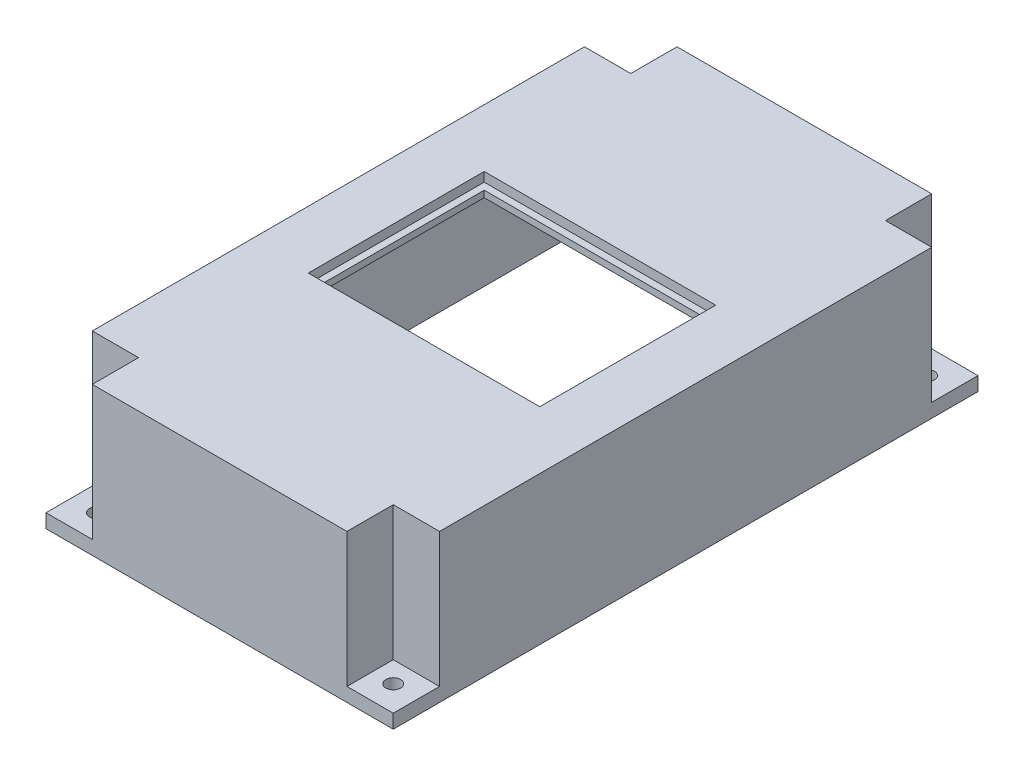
ISO-10303-21;
HEADER;
FILE_DESCRIPTION(('STEP AP214'),'2;1');
FILE_NAME('part.step','',(''),(''),'','','');
FILE_SCHEMA(('AUTOMOTIVE_DESIGN { 1 0 10303 214 1 1 1 1 }'));
ENDSEC;
DATA;
#1=APPLICATION_CONTEXT('core data for automotive mechanical design processes');
#2=APPLICATION_PROTOCOL_DEFINITION('international standard','automotive_design',2000,#1);
#3=PRODUCT_CONTEXT('',#1,'mechanical');
#4=PRODUCT('Part','Part','',(#3));
#5=PRODUCT_RELATED_PRODUCT_CATEGORY('part','',(#4));
#6=PRODUCT_DEFINITION_FORMATION('','',#4);
#7=PRODUCT_DEFINITION_CONTEXT('part definition',#1,'design');
#8=PRODUCT_DEFINITION('design','',#6,#7);
#9=PRODUCT_DEFINITION_SHAPE('','',#8);
#10=(LENGTH_UNIT() NAMED_UNIT(*) SI_UNIT(.MILLI.,.METRE.));
#11=(NAMED_UNIT(*) PLANE_ANGLE_UNIT() SI_UNIT($,.RADIAN.));
#12=(NAMED_UNIT(*) SI_UNIT($,.STERADIAN.) SOLID_ANGLE_UNIT());
#13=UNCERTAINTY_MEASURE_WITH_UNIT(LENGTH_MEASURE(1.E-05),#10,'distance_accuracy_value','');
#14=(GEOMETRIC_REPRESENTATION_CONTEXT(3) GLOBAL_UNCERTAINTY_ASSIGNED_CONTEXT((#13)) GLOBAL_UNIT_ASSIGNED_CONTEXT((#10,
#11,#12)) REPRESENTATION_CONTEXT('',''));
#15=CARTESIAN_POINT('',(0.,0.,0.));
#16=DIRECTION('',(0.,0.,1.));
#17=DIRECTION('',(1.,0.,0.));
#18=AXIS2_PLACEMENT_3D('',#15,#16,#17);
#19=CARTESIAN_POINT('',(0.,30.,0.));
#20=DIRECTION('',(0.,1.,0.));
#21=DIRECTION('',(0.,0.,1.));
#22=AXIS2_PLACEMENT_3D('',#19,#20,#21);
#23=PLANE('',#22);
#24=DIRECTION('',(0.,0.,-1.));
#25=VECTOR('',#24,1.);
#26=CARTESIAN_POINT('',(-54.9274268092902,30.,-65.941177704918));
#27=LINE('',#26,#25);
#28=CARTESIAN_POINT('',(-54.9274268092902,30.,-22.441177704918));
#29=VERTEX_POINT('',#28);
#30=CARTESIAN_POINT('',(-54.9274268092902,30.,-67.441177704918));
#31=VERTEX_POINT('',#30);
#32=EDGE_CURVE('E618',#29,#31,#27,.T.);
#33=ORIENTED_EDGE('',*,*,#32,.T.);
#34=DIRECTION('',(-1.,0.,0.));
#35=VECTOR('',#34,1.);
#36=CARTESIAN_POINT('',(-110.42742680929,30.,-67.441177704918));
#37=LINE('',#36,#35);
#38=CARTESIAN_POINT('',(-111.92742680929,30.,-67.441177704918));
#39=VERTEX_POINT('',#38);
#40=EDGE_CURVE('E620',#31,#39,#37,.T.);
#41=ORIENTED_EDGE('',*,*,#40,.T.);
#42=DIRECTION('',(0.,0.,1.));
#43=VECTOR('',#42,1.);
#44=CARTESIAN_POINT('',(-111.92742680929,30.,0.));
#45=LINE('',#44,#43);
#46=CARTESIAN_POINT('',(-111.92742680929,30.,-22.441177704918));
#47=VERTEX_POINT('',#46);
#48=EDGE_CURVE('E616',#39,#47,#45,.T.);
#49=ORIENTED_EDGE('',*,*,#48,.T.);
#50=DIRECTION('',(1.,0.,0.));
#51=VECTOR('',#50,1.);
#52=CARTESIAN_POINT('',(0.,30.,-22.441177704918));
#53=LINE('',#52,#51);
#54=EDGE_CURVE('E592',#47,#29,#53,.T.);
#55=ORIENTED_EDGE('',*,*,#54,.T.);
#56=EDGE_LOOP('',(#33,#41,#49,#55));
#57=FACE_BOUND('',#56,.T.);
#58=DIRECTION('',(0.,0.,-1.));
#59=VECTOR('',#58,1.);
#60=CARTESIAN_POINT('',(-47.9274268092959,30.,0.));
#61=LINE('',#60,#59);
#62=CARTESIAN_POINT('',(-47.9274268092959,30.,6.20882229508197));
#63=VERTEX_POINT('',#62);
#64=CARTESIAN_POINT('',(-47.9274268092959,30.,-96.091177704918));
#65=VERTEX_POINT('',#64);
#66=EDGE_CURVE('E479',#63,#65,#61,.T.);
#67=ORIENTED_EDGE('',*,*,#66,.F.);
#68=DIRECTION('',(-1.,0.,0.));
#69=VECTOR('',#68,1.);
#70=CARTESIAN_POINT('',(0.,30.,6.20882229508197));
#71=LINE('',#70,#69);
#72=CARTESIAN_POINT('',(-57.9274268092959,30.,6.20882229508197));
#73=VERTEX_POINT('',#72);
#74=EDGE_CURVE('E482',#63,#73,#71,.T.);
#75=ORIENTED_EDGE('',*,*,#74,.T.);
#76=DIRECTION('',(0.,0.,-1.));
#77=VECTOR('',#76,1.);
#78=CARTESIAN_POINT('',(-57.9274268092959,30.,0.));
#79=LINE('',#78,#77);
#80=CARTESIAN_POINT('',(-57.9274268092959,30.,16.208822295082));
#81=VERTEX_POINT('',#80);
#82=EDGE_CURVE('E485',#81,#73,#79,.T.);
#83=ORIENTED_EDGE('',*,*,#82,.F.);
#84=DIRECTION('',(1.,0.,0.));
#85=VECTOR('',#84,1.);
#86=CARTESIAN_POINT('',(0.,30.,16.208822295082));
#87=LINE('',#86,#85);
#88=CARTESIAN_POINT('',(-108.92742680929,30.,16.208822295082));
#89=VERTEX_POINT('',#88);
#90=EDGE_CURVE('E488',#89,#81,#87,.T.);
#91=ORIENTED_EDGE('',*,*,#90,.F.);
#92=DIRECTION('',(0.,0.,-1.));
#93=VECTOR('',#92,1.);
#94=CARTESIAN_POINT('',(-108.92742680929,30.,0.));
#95=LINE('',#94,#93);
#96=CARTESIAN_POINT('',(-108.92742680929,30.,6.20882229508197));
#97=VERTEX_POINT('',#96);
#98=EDGE_CURVE('E491',#89,#97,#95,.T.);
#99=ORIENTED_EDGE('',*,*,#98,.T.);
#100=DIRECTION('',(1.,0.,0.));
#101=VECTOR('',#100,1.);
#102=CARTESIAN_POINT('',(0.,30.,6.20882229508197));
#103=LINE('',#102,#101);
#104=CARTESIAN_POINT('',(-118.92742680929,30.,6.20882229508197));
#105=VERTEX_POINT('',#104);
#106=EDGE_CURVE('E493',#105,#97,#103,.T.);
#107=ORIENTED_EDGE('',*,*,#106,.F.);
#108=DIRECTION('',(0.,0.,1.));
#109=VECTOR('',#108,1.);
#110=CARTESIAN_POINT('',(-118.92742680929,30.,0.));
#111=LINE('',#110,#109);
#112=CARTESIAN_POINT('',(-118.92742680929,30.,-96.091177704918));
#113=VERTEX_POINT('',#112);
#114=EDGE_CURVE('E496',#113,#105,#111,.T.);
#115=ORIENTED_EDGE('',*,*,#114,.F.);
#116=DIRECTION('',(1.,0.,0.));
#117=VECTOR('',#116,1.);
#118=CARTESIAN_POINT('',(0.,30.,-96.091177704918));
#119=LINE('',#118,#117);
#120=CARTESIAN_POINT('',(-108.92742680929,30.,-96.091177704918));
#121=VERTEX_POINT('',#120);
#122=EDGE_CURVE('E499',#113,#121,#119,.T.);
#123=ORIENTED_EDGE('',*,*,#122,.T.);
#124=DIRECTION('',(0.,0.,1.));
#125=VECTOR('',#124,1.);
#126=CARTESIAN_POINT('',(-108.92742680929,30.,0.));
#127=LINE('',#126,#125);
#128=CARTESIAN_POINT('',(-108.92742680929,30.,-106.091177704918));
#129=VERTEX_POINT('',#128);
#130=EDGE_CURVE('E501',#129,#121,#127,.T.);
#131=ORIENTED_EDGE('',*,*,#130,.F.);
#132=DIRECTION('',(-1.,0.,0.));
#133=VECTOR('',#132,1.);
#134=CARTESIAN_POINT('',(0.,30.,-106.091177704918));
#135=LINE('',#134,#133);
#136=CARTESIAN_POINT('',(-57.9274268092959,30.,-106.091177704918));
#137=VERTEX_POINT('',#136);
#138=EDGE_CURVE('E504',#137,#129,#135,.T.);
#139=ORIENTED_EDGE('',*,*,#138,.F.);
#140=DIRECTION('',(0.,0.,1.));
#141=VECTOR('',#140,1.);
#142=CARTESIAN_POINT('',(-57.9274268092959,30.,0.));
#143=LINE('',#142,#141);
#144=CARTESIAN_POINT('',(-57.9274268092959,30.,-96.091177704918));
#145=VERTEX_POINT('',#144);
#146=EDGE_CURVE('E507',#137,#145,#143,.T.);
#147=ORIENTED_EDGE('',*,*,#146,.T.);
#148=DIRECTION('',(-1.,0.,0.));
#149=VECTOR('',#148,1.);
#150=CARTESIAN_POINT('',(0.,30.,-96.091177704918));
#151=LINE('',#150,#149);
#152=EDGE_CURVE('E509',#65,#145,#151,.T.);
#153=ORIENTED_EDGE('',*,*,#152,.F.);
#154=EDGE_LOOP('',(#67,#75,#83,#91,#99,#107,#115,#123,#131,#139,#147,#153));
#155=FACE_BOUND('',#154,.T.);
#156=ADVANCED_FACE('F39',(#57,#155),#23,.F.);
#157=CARTESIAN_POINT('',(0.,32.,0.));
#158=DIRECTION('',(0.,1.,0.));
#159=DIRECTION('',(0.,0.,1.));
#160=AXIS2_PLACEMENT_3D('',#157,#158,#159);
#161=PLANE('',#160);
#162=DIRECTION('',(-1.,0.,0.));
#163=VECTOR('',#162,1.);
#164=CARTESIAN_POINT('',(-110.92742680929,32.,-98.091177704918));
#165=LINE('',#164,#163);
#166=CARTESIAN_POINT('',(-110.92742680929,32.,-98.091177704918));
#167=VERTEX_POINT('',#166);
#168=CARTESIAN_POINT('',(-120.92742680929,32.,-98.091177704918));
#169=VERTEX_POINT('',#168);
#170=EDGE_CURVE('E366',#167,#169,#165,.T.);
#171=ORIENTED_EDGE('',*,*,#170,.T.);
#172=DIRECTION('',(0.,0.,1.));
#173=VECTOR('',#172,1.);
#174=CARTESIAN_POINT('',(-120.92742680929,32.,-98.091177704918));
#175=LINE('',#174,#173);
#176=CARTESIAN_POINT('',(-120.92742680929,32.,8.20882229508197));
#177=VERTEX_POINT('',#176);
#178=EDGE_CURVE('E369',#169,#177,#175,.T.);
#179=ORIENTED_EDGE('',*,*,#178,.T.);
#180=DIRECTION('',(1.,0.,0.));
#181=VECTOR('',#180,1.);
#182=CARTESIAN_POINT('',(-120.92742680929,32.,8.20882229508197));
#183=LINE('',#182,#181);
#184=CARTESIAN_POINT('',(-110.92742680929,32.,8.20882229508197));
#185=VERTEX_POINT('',#184);
#186=EDGE_CURVE('E372',#177,#185,#183,.T.);
#187=ORIENTED_EDGE('',*,*,#186,.T.);
#188=DIRECTION('',(0.,0.,1.));
#189=VECTOR('',#188,1.);
#190=CARTESIAN_POINT('',(-110.92742680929,32.,8.20882229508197));
#191=LINE('',#190,#189);
#192=CARTESIAN_POINT('',(-110.92742680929,32.,18.208822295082));
#193=VERTEX_POINT('',#192);
#194=EDGE_CURVE('E375',#185,#193,#191,.T.);
#195=ORIENTED_EDGE('',*,*,#194,.T.);
#196=DIRECTION('',(1.,0.,0.));
#197=VECTOR('',#196,1.);
#198=CARTESIAN_POINT('',(-110.92742680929,32.,18.208822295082));
#199=LINE('',#198,#197);
#200=CARTESIAN_POINT('',(-55.9274268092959,32.,18.208822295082));
#201=VERTEX_POINT('',#200);
#202=EDGE_CURVE('E378',#193,#201,#199,.T.);
#203=ORIENTED_EDGE('',*,*,#202,.T.);
#204=DIRECTION('',(0.,0.,-1.));
#205=VECTOR('',#204,1.);
#206=CARTESIAN_POINT('',(-55.9274268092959,32.,18.208822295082));
#207=LINE('',#206,#205);
#208=CARTESIAN_POINT('',(-55.9274268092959,32.,8.20882229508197));
#209=VERTEX_POINT('',#208);
#210=EDGE_CURVE('E381',#201,#209,#207,.T.);
#211=ORIENTED_EDGE('',*,*,#210,.T.);
#212=DIRECTION('',(1.,0.,0.));
#213=VECTOR('',#212,1.);
#214=CARTESIAN_POINT('',(-55.9274268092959,32.,8.20882229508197));
#215=LINE('',#214,#213);
#216=CARTESIAN_POINT('',(-45.9274268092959,32.,8.20882229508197));
#217=VERTEX_POINT('',#216);
#218=EDGE_CURVE('E384',#209,#217,#215,.T.);
#219=ORIENTED_EDGE('',*,*,#218,.T.);
#220=DIRECTION('',(0.,0.,-1.));
#221=VECTOR('',#220,1.);
#222=CARTESIAN_POINT('',(-45.9274268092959,32.,8.20882229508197));
#223=LINE('',#222,#221);
#224=CARTESIAN_POINT('',(-45.9274268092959,32.,-98.091177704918));
#225=VERTEX_POINT('',#224);
#226=EDGE_CURVE('E387',#217,#225,#223,.T.);
#227=ORIENTED_EDGE('',*,*,#226,.T.);
#228=DIRECTION('',(-1.,0.,0.));
#229=VECTOR('',#228,1.);
#230=CARTESIAN_POINT('',(-45.9274268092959,32.,-98.091177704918));
#231=LINE('',#230,#229);
#232=CARTESIAN_POINT('',(-55.9274268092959,32.,-98.091177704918));
#233=VERTEX_POINT('',#232);
#234=EDGE_CURVE('E390',#225,#233,#231,.T.);
#235=ORIENTED_EDGE('',*,*,#234,.T.);
#236=DIRECTION('',(0.,0.,-1.));
#237=VECTOR('',#236,1.);
#238=CARTESIAN_POINT('',(-55.9274268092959,32.,-98.091177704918));
#239=LINE('',#238,#237);
#240=CARTESIAN_POINT('',(-55.9274268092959,32.,-108.091177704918));
#241=VERTEX_POINT('',#240);
#242=EDGE_CURVE('E393',#233,#241,#239,.T.);
#243=ORIENTED_EDGE('',*,*,#242,.T.);
#244=DIRECTION('',(-1.,0.,0.));
#245=VECTOR('',#244,1.);
#246=CARTESIAN_POINT('',(-55.9274268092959,32.,-108.091177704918));
#247=LINE('',#246,#245);
#248=CARTESIAN_POINT('',(-110.92742680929,32.,-108.091177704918));
#249=VERTEX_POINT('',#248);
#250=EDGE_CURVE('E396',#241,#249,#247,.T.);
#251=ORIENTED_EDGE('',*,*,#250,.T.);
#252=DIRECTION('',(0.,0.,1.));
#253=VECTOR('',#252,1.);
#254=CARTESIAN_POINT('',(-110.92742680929,32.,-108.091177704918));
#255=LINE('',#254,#253);
#256=EDGE_CURVE('E399',#249,#167,#255,.T.);
#257=ORIENTED_EDGE('',*,*,#256,.T.);
#258=EDGE_LOOP('',(#171,#179,#187,#195,#203,#211,#219,#227,#235,#243,#251,#257));
#259=FACE_BOUND('',#258,.T.);
#260=DIRECTION('',(1.,0.,0.));
#261=VECTOR('',#260,1.);
#262=CARTESIAN_POINT('',(0.,32.,-63.941177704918));
#263=LINE('',#262,#261);
#264=CARTESIAN_POINT('',(-108.42742680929,32.,-63.941177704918));
#265=VERTEX_POINT('',#264);
#266=CARTESIAN_POINT('',(-58.4274268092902,32.,-63.941177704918));
#267=VERTEX_POINT('',#266);
#268=EDGE_CURVE('E338',#265,#267,#263,.T.);
#269=ORIENTED_EDGE('',*,*,#268,.T.);
#270=DIRECTION('',(0.,0.,1.));
#271=VECTOR('',#270,1.);
#272=CARTESIAN_POINT('',(-58.4274268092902,32.,0.));
#273=LINE('',#272,#271);
#274=CARTESIAN_POINT('',(-58.4274268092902,32.,-25.941177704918));
#275=VERTEX_POINT('',#274);
#276=EDGE_CURVE('E304',#267,#275,#273,.T.);
#277=ORIENTED_EDGE('',*,*,#276,.T.);
#278=DIRECTION('',(1.,0.,0.));
#279=VECTOR('',#278,1.);
#280=CARTESIAN_POINT('',(0.,32.,-25.941177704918));
#281=LINE('',#280,#279);
#282=CARTESIAN_POINT('',(-108.42742680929,32.,-25.941177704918));
#283=VERTEX_POINT('',#282);
#284=EDGE_CURVE('E344',#283,#275,#281,.T.);
#285=ORIENTED_EDGE('',*,*,#284,.F.);
#286=DIRECTION('',(0.,0.,1.));
#287=VECTOR('',#286,1.);
#288=CARTESIAN_POINT('',(-108.42742680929,32.,0.));
#289=LINE('',#288,#287);
#290=EDGE_CURVE('E341',#265,#283,#289,.T.);
#291=ORIENTED_EDGE('',*,*,#290,.F.);
#292=EDGE_LOOP('',(#269,#277,#285,#291));
#293=FACE_BOUND('',#292,.T.);
#294=ADVANCED_FACE('F668',(#259,#293),#161,.T.);
#295=CARTESIAN_POINT('',(-120.92742680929,30.,0.));
#296=DIRECTION('',(1.,0.,0.));
#297=DIRECTION('',(0.,0.,-1.));
#298=AXIS2_PLACEMENT_3D('',#295,#296,#297);
#299=PLANE('',#298);
#300=DIRECTION('',(0.,0.,1.));
#301=VECTOR('',#300,1.);
#302=CARTESIAN_POINT('',(-120.92742680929,0.,0.));
#303=LINE('',#302,#301);
#304=CARTESIAN_POINT('',(-120.92742680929,0.,-108.091177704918));
#305=VERTEX_POINT('',#304);
#306=CARTESIAN_POINT('',(-120.92742680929,0.,18.208822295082));
#307=VERTEX_POINT('',#306);
#308=EDGE_CURVE('E548',#305,#307,#303,.T.);
#309=ORIENTED_EDGE('',*,*,#308,.T.);
#310=DIRECTION('',(0.,-1.,0.));
#311=VECTOR('',#310,1.);
#312=CARTESIAN_POINT('',(-120.92742680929,3.,18.208822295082));
#313=LINE('',#312,#311);
#314=CARTESIAN_POINT('',(-120.92742680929,3.,18.208822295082));
#315=VERTEX_POINT('',#314);
#316=EDGE_CURVE('E473',#315,#307,#313,.T.);
#317=ORIENTED_EDGE('',*,*,#316,.F.);
#318=DIRECTION('',(0.,0.,1.));
#319=VECTOR('',#318,1.);
#320=CARTESIAN_POINT('',(-120.92742680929,3.,0.));
#321=LINE('',#320,#319);
#322=CARTESIAN_POINT('',(-120.92742680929,3.,8.20882229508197));
#323=VERTEX_POINT('',#322);
#324=EDGE_CURVE('E466',#323,#315,#321,.T.);
#325=ORIENTED_EDGE('',*,*,#324,.F.);
#326=DIRECTION('',(0.,-1.,0.));
#327=VECTOR('',#326,1.);
#328=CARTESIAN_POINT('',(-120.92742680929,30.,8.20882229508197));
#329=LINE('',#328,#327);
#330=EDGE_CURVE('E589',#177,#323,#329,.T.);
#331=ORIENTED_EDGE('',*,*,#330,.F.);
#332=ORIENTED_EDGE('',*,*,#178,.F.);
#333=DIRECTION('',(0.,-1.,0.));
#334=VECTOR('',#333,1.);
#335=CARTESIAN_POINT('',(-120.92742680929,30.,-98.091177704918));
#336=LINE('',#335,#334);
#337=CARTESIAN_POINT('',(-120.92742680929,3.,-98.091177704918));
#338=VERTEX_POINT('',#337);
#339=EDGE_CURVE('E557',#169,#338,#336,.T.);
#340=ORIENTED_EDGE('',*,*,#339,.T.);
#341=DIRECTION('',(0.,0.,1.));
#342=VECTOR('',#341,1.);
#343=CARTESIAN_POINT('',(-120.92742680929,3.,0.));
#344=LINE('',#343,#342);
#345=CARTESIAN_POINT('',(-120.92742680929,3.,-108.091177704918));
#346=VERTEX_POINT('',#345);
#347=EDGE_CURVE('E410',#346,#338,#344,.T.);
#348=ORIENTED_EDGE('',*,*,#347,.F.);
#349=DIRECTION('',(0.,-1.,0.));
#350=VECTOR('',#349,1.);
#351=CARTESIAN_POINT('',(-120.92742680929,3.,-108.091177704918));
#352=LINE('',#351,#350);
#353=EDGE_CURVE('E416',#346,#305,#352,.T.);
#354=ORIENTED_EDGE('',*,*,#353,.T.);
#355=EDGE_LOOP('',(#309,#317,#325,#331,#332,#340,#348,#354));
#356=FACE_BOUND('',#355,.T.);
#357=ADVANCED_FACE('F673',(#356),#299,.F.);
#358=CARTESIAN_POINT('',(0.,30.,8.20882229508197));
#359=DIRECTION('',(0.,0.,-1.));
#360=DIRECTION('',(-1.,0.,0.));
#361=AXIS2_PLACEMENT_3D('',#358,#359,#360);
#362=PLANE('',#361);
#363=ORIENTED_EDGE('',*,*,#330,.T.);
#364=DIRECTION('',(1.,0.,0.));
#365=VECTOR('',#364,1.);
#366=CARTESIAN_POINT('',(0.,3.,8.20882229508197));
#367=LINE('',#366,#365);
#368=CARTESIAN_POINT('',(-110.92742680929,3.,8.20882229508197));
#369=VERTEX_POINT('',#368);
#370=EDGE_CURVE('E463',#323,#369,#367,.T.);
#371=ORIENTED_EDGE('',*,*,#370,.T.);
#372=DIRECTION('',(0.,-1.,0.));
#373=VECTOR('',#372,1.);
#374=CARTESIAN_POINT('',(-110.92742680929,30.,8.20882229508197));
#375=LINE('',#374,#373);
#376=EDGE_CURVE('E586',#185,#369,#375,.T.);
#377=ORIENTED_EDGE('',*,*,#376,.F.);
#378=ORIENTED_EDGE('',*,*,#186,.F.);
#379=EDGE_LOOP('',(#363,#371,#377,#378));
#380=FACE_BOUND('',#379,.T.);
#381=ADVANCED_FACE('F756',(#380),#362,.F.);
#382=CARTESIAN_POINT('',(-110.92742680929,30.,1.5394272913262E-13));
#383=DIRECTION('',(-1.,0.,0.));
#384=DIRECTION('',(0.,0.,1.));
#385=AXIS2_PLACEMENT_3D('',#382,#383,#384);
#386=PLANE('',#385);
#387=DIRECTION('',(0.,0.,-1.));
#388=VECTOR('',#387,1.);
#389=CARTESIAN_POINT('',(-110.92742680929,3.,1.5394272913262E-13));
#390=LINE('',#389,#388);
#391=CARTESIAN_POINT('',(-110.92742680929,3.,18.208822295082));
#392=VERTEX_POINT('',#391);
#393=EDGE_CURVE('E471',#392,#369,#390,.T.);
#394=ORIENTED_EDGE('',*,*,#393,.F.);
#395=DIRECTION('',(0.,-1.,0.));
#396=VECTOR('',#395,1.);
#397=CARTESIAN_POINT('',(-110.92742680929,30.,18.208822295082));
#398=LINE('',#397,#396);
#399=EDGE_CURVE('E583',#193,#392,#398,.T.);
#400=ORIENTED_EDGE('',*,*,#399,.F.);
#401=ORIENTED_EDGE('',*,*,#194,.F.);
#402=ORIENTED_EDGE('',*,*,#376,.T.);
#403=EDGE_LOOP('',(#394,#400,#401,#402));
#404=FACE_BOUND('',#403,.T.);
#405=ADVANCED_FACE('F752',(#404),#386,.T.);
#406=CARTESIAN_POINT('',(0.,30.,18.208822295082));
#407=DIRECTION('',(0.,0.,-1.));
#408=DIRECTION('',(-1.,0.,0.));
#409=AXIS2_PLACEMENT_3D('',#406,#407,#408);
#410=PLANE('',#409);
#411=DIRECTION('',(1.,0.,0.));
#412=VECTOR('',#411,1.);
#413=CARTESIAN_POINT('',(0.,0.,18.208822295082));
#414=LINE('',#413,#412);
#415=CARTESIAN_POINT('',(-45.9274268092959,0.,18.208822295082));
#416=VERTEX_POINT('',#415);
#417=EDGE_CURVE('E550',#307,#416,#414,.T.);
#418=ORIENTED_EDGE('',*,*,#417,.T.);
#419=DIRECTION('',(0.,-1.,0.));
#420=VECTOR('',#419,1.);
#421=CARTESIAN_POINT('',(-45.9274268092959,3.,18.208822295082));
#422=LINE('',#421,#420);
#423=CARTESIAN_POINT('',(-45.9274268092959,3.,18.208822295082));
#424=VERTEX_POINT('',#423);
#425=EDGE_CURVE('E454',#424,#416,#422,.T.);
#426=ORIENTED_EDGE('',*,*,#425,.F.);
#427=DIRECTION('',(1.,0.,0.));
#428=VECTOR('',#427,1.);
#429=CARTESIAN_POINT('',(0.,3.,18.208822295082));
#430=LINE('',#429,#428);
#431=CARTESIAN_POINT('',(-55.9274268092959,3.,18.208822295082));
#432=VERTEX_POINT('',#431);
#433=EDGE_CURVE('E447',#432,#424,#430,.T.);
#434=ORIENTED_EDGE('',*,*,#433,.F.);
#435=DIRECTION('',(0.,-1.,0.));
#436=VECTOR('',#435,1.);
#437=CARTESIAN_POINT('',(-55.9274268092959,30.,18.208822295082));
#438=LINE('',#437,#436);
#439=EDGE_CURVE('E580',#201,#432,#438,.T.);
#440=ORIENTED_EDGE('',*,*,#439,.F.);
#441=ORIENTED_EDGE('',*,*,#202,.F.);
#442=ORIENTED_EDGE('',*,*,#399,.T.);
#443=DIRECTION('',(1.,0.,0.));
#444=VECTOR('',#443,1.);
#445=CARTESIAN_POINT('',(0.,3.,18.208822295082));
#446=LINE('',#445,#444);
#447=EDGE_CURVE('E469',#315,#392,#446,.T.);
#448=ORIENTED_EDGE('',*,*,#447,.F.);
#449=ORIENTED_EDGE('',*,*,#316,.T.);
#450=EDGE_LOOP('',(#418,#426,#434,#440,#441,#442,#448,#449));
#451=FACE_BOUND('',#450,.T.);
#452=ADVANCED_FACE('F748',(#451),#410,.F.);
#453=CARTESIAN_POINT('',(-55.9274268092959,30.,0.));
#454=DIRECTION('',(-1.,0.,0.));
#455=DIRECTION('',(0.,0.,1.));
#456=AXIS2_PLACEMENT_3D('',#453,#454,#455);
#457=PLANE('',#456);
#458=ORIENTED_EDGE('',*,*,#439,.T.);
#459=DIRECTION('',(0.,0.,-1.));
#460=VECTOR('',#459,1.);
#461=CARTESIAN_POINT('',(-55.9274268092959,3.,0.));
#462=LINE('',#461,#460);
#463=CARTESIAN_POINT('',(-55.9274268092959,3.,8.20882229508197));
#464=VERTEX_POINT('',#463);
#465=EDGE_CURVE('E444',#432,#464,#462,.T.);
#466=ORIENTED_EDGE('',*,*,#465,.T.);
#467=DIRECTION('',(0.,-1.,0.));
#468=VECTOR('',#467,1.);
#469=CARTESIAN_POINT('',(-55.9274268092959,30.,8.20882229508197));
#470=LINE('',#469,#468);
#471=EDGE_CURVE('E577',#209,#464,#470,.T.);
#472=ORIENTED_EDGE('',*,*,#471,.F.);
#473=ORIENTED_EDGE('',*,*,#210,.F.);
#474=EDGE_LOOP('',(#458,#466,#472,#473));
#475=FACE_BOUND('',#474,.T.);
#476=ADVANCED_FACE('F744',(#475),#457,.F.);
#477=CARTESIAN_POINT('',(0.,30.,8.20882229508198));
#478=DIRECTION('',(0.,0.,1.));
#479=DIRECTION('',(1.,0.,0.));
#480=AXIS2_PLACEMENT_3D('',#477,#478,#479);
#481=PLANE('',#480);
#482=DIRECTION('',(-1.,0.,0.));
#483=VECTOR('',#482,1.);
#484=CARTESIAN_POINT('',(0.,3.,8.20882229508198));
#485=LINE('',#484,#483);
#486=CARTESIAN_POINT('',(-45.9274268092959,3.,8.20882229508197));
#487=VERTEX_POINT('',#486);
#488=EDGE_CURVE('E452',#487,#464,#485,.T.);
#489=ORIENTED_EDGE('',*,*,#488,.F.);
#490=DIRECTION('',(0.,-1.,0.));
#491=VECTOR('',#490,1.);
#492=CARTESIAN_POINT('',(-45.9274268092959,30.,8.20882229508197));
#493=LINE('',#492,#491);
#494=EDGE_CURVE('E574',#217,#487,#493,.T.);
#495=ORIENTED_EDGE('',*,*,#494,.F.);
#496=ORIENTED_EDGE('',*,*,#218,.F.);
#497=ORIENTED_EDGE('',*,*,#471,.T.);
#498=EDGE_LOOP('',(#489,#495,#496,#497));
#499=FACE_BOUND('',#498,.T.);
#500=ADVANCED_FACE('F740',(#499),#481,.T.);
#501=CARTESIAN_POINT('',(-45.9274268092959,30.,0.));
#502=DIRECTION('',(-1.,0.,0.));
#503=DIRECTION('',(0.,0.,1.));
#504=AXIS2_PLACEMENT_3D('',#501,#502,#503);
#505=PLANE('',#504);
#506=DIRECTION('',(0.,0.,-1.));
#507=VECTOR('',#506,1.);
#508=CARTESIAN_POINT('',(-45.9274268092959,0.,0.));
#509=LINE('',#508,#507);
#510=CARTESIAN_POINT('',(-45.9274268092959,0.,-108.091177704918));
#511=VERTEX_POINT('',#510);
#512=EDGE_CURVE('E552',#416,#511,#509,.T.);
#513=ORIENTED_EDGE('',*,*,#512,.T.);
#514=DIRECTION('',(0.,-1.,0.));
#515=VECTOR('',#514,1.);
#516=CARTESIAN_POINT('',(-45.9274268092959,3.,-108.091177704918));
#517=LINE('',#516,#515);
#518=CARTESIAN_POINT('',(-45.9274268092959,3.,-108.091177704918));
#519=VERTEX_POINT('',#518);
#520=EDGE_CURVE('E435',#519,#511,#517,.T.);
#521=ORIENTED_EDGE('',*,*,#520,.F.);
#522=DIRECTION('',(0.,0.,-1.));
#523=VECTOR('',#522,1.);
#524=CARTESIAN_POINT('',(-45.9274268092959,3.,0.));
#525=LINE('',#524,#523);
#526=CARTESIAN_POINT('',(-45.9274268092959,3.,-98.091177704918));
#527=VERTEX_POINT('',#526);
#528=EDGE_CURVE('E430',#527,#519,#525,.T.);
#529=ORIENTED_EDGE('',*,*,#528,.F.);
#530=DIRECTION('',(0.,-1.,0.));
#531=VECTOR('',#530,1.);
#532=CARTESIAN_POINT('',(-45.9274268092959,30.,-98.091177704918));
#533=LINE('',#532,#531);
#534=EDGE_CURVE('E572',#225,#527,#533,.T.);
#535=ORIENTED_EDGE('',*,*,#534,.F.);
#536=ORIENTED_EDGE('',*,*,#226,.F.);
#537=ORIENTED_EDGE('',*,*,#494,.T.);
#538=DIRECTION('',(0.,0.,-1.));
#539=VECTOR('',#538,1.);
#540=CARTESIAN_POINT('',(-45.9274268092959,3.,0.));
#541=LINE('',#540,#539);
#542=EDGE_CURVE('E450',#424,#487,#541,.T.);
#543=ORIENTED_EDGE('',*,*,#542,.F.);
#544=ORIENTED_EDGE('',*,*,#425,.T.);
#545=EDGE_LOOP('',(#513,#521,#529,#535,#536,#537,#543,#544));
#546=FACE_BOUND('',#545,.T.);
#547=ADVANCED_FACE('F736',(#546),#505,.F.);
#548=CARTESIAN_POINT('',(0.,30.,-98.091177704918));
#549=DIRECTION('',(0.,0.,1.));
#550=DIRECTION('',(1.,0.,0.));
#551=AXIS2_PLACEMENT_3D('',#548,#549,#550);
#552=PLANE('',#551);
#553=ORIENTED_EDGE('',*,*,#534,.T.);
#554=DIRECTION('',(-1.,0.,0.));
#555=VECTOR('',#554,1.);
#556=CARTESIAN_POINT('',(0.,3.,-98.091177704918));
#557=LINE('',#556,#555);
#558=CARTESIAN_POINT('',(-55.9274268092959,3.,-98.091177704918));
#559=VERTEX_POINT('',#558);
#560=EDGE_CURVE('E428',#527,#559,#557,.T.);
#561=ORIENTED_EDGE('',*,*,#560,.T.);
#562=DIRECTION('',(0.,-1.,0.));
#563=VECTOR('',#562,1.);
#564=CARTESIAN_POINT('',(-55.9274268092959,30.,-98.091177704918));
#565=LINE('',#564,#563);
#566=EDGE_CURVE('E569',#233,#559,#565,.T.);
#567=ORIENTED_EDGE('',*,*,#566,.F.);
#568=ORIENTED_EDGE('',*,*,#234,.F.);
#569=EDGE_LOOP('',(#553,#561,#567,#568));
#570=FACE_BOUND('',#569,.T.);
#571=ADVANCED_FACE('F732',(#570),#552,.F.);
#572=CARTESIAN_POINT('',(-55.9274268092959,30.,0.));
#573=DIRECTION('',(1.,0.,0.));
#574=DIRECTION('',(0.,0.,-1.));
#575=AXIS2_PLACEMENT_3D('',#572,#573,#574);
#576=PLANE('',#575);
#577=DIRECTION('',(0.,0.,1.));
#578=VECTOR('',#577,1.);
#579=CARTESIAN_POINT('',(-55.9274268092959,3.,0.));
#580=LINE('',#579,#578);
#581=CARTESIAN_POINT('',(-55.9274268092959,3.,-108.091177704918));
#582=VERTEX_POINT('',#581);
#583=EDGE_CURVE('E425',#582,#559,#580,.T.);
#584=ORIENTED_EDGE('',*,*,#583,.F.);
#585=DIRECTION('',(0.,-1.,0.));
#586=VECTOR('',#585,1.);
#587=CARTESIAN_POINT('',(-55.9274268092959,30.,-108.091177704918));
#588=LINE('',#587,#586);
#589=EDGE_CURVE('E566',#241,#582,#588,.T.);
#590=ORIENTED_EDGE('',*,*,#589,.F.);
#591=ORIENTED_EDGE('',*,*,#242,.F.);
#592=ORIENTED_EDGE('',*,*,#566,.T.);
#593=EDGE_LOOP('',(#584,#590,#591,#592));
#594=FACE_BOUND('',#593,.T.);
#595=ADVANCED_FACE('F728',(#594),#576,.T.);
#596=CARTESIAN_POINT('',(0.,30.,-108.091177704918));
#597=DIRECTION('',(0.,0.,1.));
#598=DIRECTION('',(1.,0.,0.));
#599=AXIS2_PLACEMENT_3D('',#596,#597,#598);
#600=PLANE('',#599);
#601=DIRECTION('',(-1.,0.,0.));
#602=VECTOR('',#601,1.);
#603=CARTESIAN_POINT('',(0.,0.,-108.091177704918));
#604=LINE('',#603,#602);
#605=EDGE_CURVE('E483',#511,#305,#604,.T.);
#606=ORIENTED_EDGE('',*,*,#605,.T.);
#607=ORIENTED_EDGE('',*,*,#353,.F.);
#608=DIRECTION('',(-1.,0.,0.));
#609=VECTOR('',#608,1.);
#610=CARTESIAN_POINT('',(0.,3.,-108.091177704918));
#611=LINE('',#610,#609);
#612=CARTESIAN_POINT('',(-110.92742680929,3.,-108.091177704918));
#613=VERTEX_POINT('',#612);
#614=EDGE_CURVE('E408',#613,#346,#611,.T.);
#615=ORIENTED_EDGE('',*,*,#614,.F.);
#616=DIRECTION('',(0.,-1.,0.));
#617=VECTOR('',#616,1.);
#618=CARTESIAN_POINT('',(-110.92742680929,30.,-108.091177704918));
#619=LINE('',#618,#617);
#620=EDGE_CURVE('E564',#249,#613,#619,.T.);
#621=ORIENTED_EDGE('',*,*,#620,.F.);
#622=ORIENTED_EDGE('',*,*,#250,.F.);
#623=ORIENTED_EDGE('',*,*,#589,.T.);
#624=DIRECTION('',(-1.,0.,0.));
#625=VECTOR('',#624,1.);
#626=CARTESIAN_POINT('',(0.,3.,-108.091177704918));
#627=LINE('',#626,#625);
#628=EDGE_CURVE('E422',#519,#582,#627,.T.);
#629=ORIENTED_EDGE('',*,*,#628,.F.);
#630=ORIENTED_EDGE('',*,*,#520,.T.);
#631=EDGE_LOOP('',(#606,#607,#615,#621,#622,#623,#629,#630));
#632=FACE_BOUND('',#631,.T.);
#633=ADVANCED_FACE('F724',(#632),#600,.F.);
#634=CARTESIAN_POINT('',(-110.92742680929,30.,0.));
#635=DIRECTION('',(1.,0.,0.));
#636=DIRECTION('',(0.,0.,-1.));
#637=AXIS2_PLACEMENT_3D('',#634,#635,#636);
#638=PLANE('',#637);
#639=ORIENTED_EDGE('',*,*,#620,.T.);
#640=DIRECTION('',(0.,0.,1.));
#641=VECTOR('',#640,1.);
#642=CARTESIAN_POINT('',(-110.92742680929,3.,0.));
#643=LINE('',#642,#641);
#644=CARTESIAN_POINT('',(-110.92742680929,3.,-98.091177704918));
#645=VERTEX_POINT('',#644);
#646=EDGE_CURVE('E406',#613,#645,#643,.T.);
#647=ORIENTED_EDGE('',*,*,#646,.T.);
#648=DIRECTION('',(0.,-1.,0.));
#649=VECTOR('',#648,1.);
#650=CARTESIAN_POINT('',(-110.92742680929,30.,-98.091177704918));
#651=LINE('',#650,#649);
#652=EDGE_CURVE('E560',#167,#645,#651,.T.);
#653=ORIENTED_EDGE('',*,*,#652,.F.);
#654=ORIENTED_EDGE('',*,*,#256,.F.);
#655=EDGE_LOOP('',(#639,#647,#653,#654));
#656=FACE_BOUND('',#655,.T.);
#657=ADVANCED_FACE('F720',(#656),#638,.F.);
#658=CARTESIAN_POINT('',(-47.9274268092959,30.,0.));
#659=DIRECTION('',(-1.,0.,0.));
#660=DIRECTION('',(0.,0.,1.));
#661=AXIS2_PLACEMENT_3D('',#658,#659,#660);
#662=PLANE('',#661);
#663=DIRECTION('',(0.,0.,-1.));
#664=VECTOR('',#663,1.);
#665=CARTESIAN_POINT('',(-47.9274268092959,0.,0.));
#666=LINE('',#665,#664);
#667=CARTESIAN_POINT('',(-47.9274268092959,0.,6.20882229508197));
#668=VERTEX_POINT('',#667);
#669=CARTESIAN_POINT('',(-47.9274268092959,0.,-96.091177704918));
#670=VERTEX_POINT('',#669);
#671=EDGE_CURVE('E478',#668,#670,#666,.T.);
#672=ORIENTED_EDGE('',*,*,#671,.F.);
#673=DIRECTION('',(0.,-1.,0.));
#674=VECTOR('',#673,1.);
#675=CARTESIAN_POINT('',(-47.9274268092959,30.,6.20882229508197));
#676=LINE('',#675,#674);
#677=EDGE_CURVE('E561',#63,#668,#676,.T.);
#678=ORIENTED_EDGE('',*,*,#677,.F.);
#679=ORIENTED_EDGE('',*,*,#66,.T.);
#680=DIRECTION('',(0.,-1.,0.));
#681=VECTOR('',#680,1.);
#682=CARTESIAN_POINT('',(-47.9274268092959,30.,-96.091177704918));
#683=LINE('',#682,#681);
#684=EDGE_CURVE('E512',#65,#670,#683,.T.);
#685=ORIENTED_EDGE('',*,*,#684,.T.);
#686=EDGE_LOOP('',(#672,#678,#679,#685));
#687=FACE_BOUND('',#686,.T.);
#688=ADVANCED_FACE('F723',(#687),#662,.T.);
#689=CARTESIAN_POINT('',(0.,30.,6.20882229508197));
#690=DIRECTION('',(0.,0.,1.));
#691=DIRECTION('',(1.,0.,0.));
#692=AXIS2_PLACEMENT_3D('',#689,#690,#691);
#693=PLANE('',#692);
#694=DIRECTION('',(-1.,0.,0.));
#695=VECTOR('',#694,1.);
#696=CARTESIAN_POINT('',(0.,0.,6.20882229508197));
#697=LINE('',#696,#695);
#698=CARTESIAN_POINT('',(-57.9274268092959,0.,6.20882229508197));
#699=VERTEX_POINT('',#698);
#700=EDGE_CURVE('E515',#668,#699,#697,.T.);
#701=ORIENTED_EDGE('',*,*,#700,.T.);
#702=DIRECTION('',(0.,-1.,0.));
#703=VECTOR('',#702,1.);
#704=CARTESIAN_POINT('',(-57.9274268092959,30.,6.20882229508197));
#705=LINE('',#704,#703);
#706=EDGE_CURVE('E612',#73,#699,#705,.T.);
#707=ORIENTED_EDGE('',*,*,#706,.F.);
#708=ORIENTED_EDGE('',*,*,#74,.F.);
#709=ORIENTED_EDGE('',*,*,#677,.T.);
#710=EDGE_LOOP('',(#701,#707,#708,#709));
#711=FACE_BOUND('',#710,.T.);
#712=ADVANCED_FACE('F802',(#711),#693,.F.);
#713=CARTESIAN_POINT('',(-57.9274268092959,30.,0.));
#714=DIRECTION('',(-1.,0.,0.));
#715=DIRECTION('',(0.,0.,1.));
#716=AXIS2_PLACEMENT_3D('',#713,#714,#715);
#717=PLANE('',#716);
#718=DIRECTION('',(0.,0.,-1.));
#719=VECTOR('',#718,1.);
#720=CARTESIAN_POINT('',(-57.9274268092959,0.,0.));
#721=LINE('',#720,#719);
#722=CARTESIAN_POINT('',(-57.9274268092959,0.,16.208822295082));
#723=VERTEX_POINT('',#722);
#724=EDGE_CURVE('E518',#723,#699,#721,.T.);
#725=ORIENTED_EDGE('',*,*,#724,.F.);
#726=DIRECTION('',(0.,-1.,0.));
#727=VECTOR('',#726,1.);
#728=CARTESIAN_POINT('',(-57.9274268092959,30.,16.208822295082));
#729=LINE('',#728,#727);
#730=EDGE_CURVE('E610',#81,#723,#729,.T.);
#731=ORIENTED_EDGE('',*,*,#730,.F.);
#732=ORIENTED_EDGE('',*,*,#82,.T.);
#733=ORIENTED_EDGE('',*,*,#706,.T.);
#734=EDGE_LOOP('',(#725,#731,#732,#733));
#735=FACE_BOUND('',#734,.T.);
#736=ADVANCED_FACE('F798',(#735),#717,.T.);
#737=CARTESIAN_POINT('',(0.,30.,16.208822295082));
#738=DIRECTION('',(0.,0.,-1.));
#739=DIRECTION('',(-1.,0.,0.));
#740=AXIS2_PLACEMENT_3D('',#737,#738,#739);
#741=PLANE('',#740);
#742=DIRECTION('',(1.,0.,0.));
#743=VECTOR('',#742,1.);
#744=CARTESIAN_POINT('',(0.,0.,16.208822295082));
#745=LINE('',#744,#743);
#746=CARTESIAN_POINT('',(-108.92742680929,0.,16.208822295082));
#747=VERTEX_POINT('',#746);
#748=EDGE_CURVE('E521',#747,#723,#745,.T.);
#749=ORIENTED_EDGE('',*,*,#748,.F.);
#750=DIRECTION('',(0.,-1.,0.));
#751=VECTOR('',#750,1.);
#752=CARTESIAN_POINT('',(-108.92742680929,30.,16.208822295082));
#753=LINE('',#752,#751);
#754=EDGE_CURVE('E608',#89,#747,#753,.T.);
#755=ORIENTED_EDGE('',*,*,#754,.F.);
#756=ORIENTED_EDGE('',*,*,#90,.T.);
#757=ORIENTED_EDGE('',*,*,#730,.T.);
#758=EDGE_LOOP('',(#749,#755,#756,#757));
#759=FACE_BOUND('',#758,.T.);
#760=ADVANCED_FACE('F794',(#759),#741,.T.);
#761=CARTESIAN_POINT('',(-108.92742680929,30.,0.));
#762=DIRECTION('',(-1.,0.,0.));
#763=DIRECTION('',(0.,0.,1.));
#764=AXIS2_PLACEMENT_3D('',#761,#762,#763);
#765=PLANE('',#764);
#766=DIRECTION('',(0.,0.,-1.));
#767=VECTOR('',#766,1.);
#768=CARTESIAN_POINT('',(-108.92742680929,0.,0.));
#769=LINE('',#768,#767);
#770=CARTESIAN_POINT('',(-108.92742680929,0.,6.20882229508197));
#771=VERTEX_POINT('',#770);
#772=EDGE_CURVE('E524',#747,#771,#769,.T.);
#773=ORIENTED_EDGE('',*,*,#772,.T.);
#774=DIRECTION('',(0.,-1.,0.));
#775=VECTOR('',#774,1.);
#776=CARTESIAN_POINT('',(-108.92742680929,30.,6.20882229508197));
#777=LINE('',#776,#775);
#778=EDGE_CURVE('E606',#97,#771,#777,.T.);
#779=ORIENTED_EDGE('',*,*,#778,.F.);
#780=ORIENTED_EDGE('',*,*,#98,.F.);
#781=ORIENTED_EDGE('',*,*,#754,.T.);
#782=EDGE_LOOP('',(#773,#779,#780,#781));
#783=FACE_BOUND('',#782,.T.);
#784=ADVANCED_FACE('F790',(#783),#765,.F.);
#785=CARTESIAN_POINT('',(0.,30.,6.20882229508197));
#786=DIRECTION('',(0.,0.,-1.));
#787=DIRECTION('',(-1.,0.,0.));
#788=AXIS2_PLACEMENT_3D('',#785,#786,#787);
#789=PLANE('',#788);
#790=DIRECTION('',(1.,0.,0.));
#791=VECTOR('',#790,1.);
#792=CARTESIAN_POINT('',(0.,0.,6.20882229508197));
#793=LINE('',#792,#791);
#794=CARTESIAN_POINT('',(-118.92742680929,0.,6.20882229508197));
#795=VERTEX_POINT('',#794);
#796=EDGE_CURVE('E527',#795,#771,#793,.T.);
#797=ORIENTED_EDGE('',*,*,#796,.F.);
#798=DIRECTION('',(0.,-1.,0.));
#799=VECTOR('',#798,1.);
#800=CARTESIAN_POINT('',(-118.92742680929,30.,6.20882229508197));
#801=LINE('',#800,#799);
#802=EDGE_CURVE('E604',#105,#795,#801,.T.);
#803=ORIENTED_EDGE('',*,*,#802,.F.);
#804=ORIENTED_EDGE('',*,*,#106,.T.);
#805=ORIENTED_EDGE('',*,*,#778,.T.);
#806=EDGE_LOOP('',(#797,#803,#804,#805));
#807=FACE_BOUND('',#806,.T.);
#808=ADVANCED_FACE('F786',(#807),#789,.T.);
#809=CARTESIAN_POINT('',(-118.92742680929,30.,0.));
#810=DIRECTION('',(1.,0.,0.));
#811=DIRECTION('',(0.,0.,-1.));
#812=AXIS2_PLACEMENT_3D('',#809,#810,#811);
#813=PLANE('',#812);
#814=DIRECTION('',(0.,0.,1.));
#815=VECTOR('',#814,1.);
#816=CARTESIAN_POINT('',(-118.92742680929,0.,0.));
#817=LINE('',#816,#815);
#818=CARTESIAN_POINT('',(-118.92742680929,0.,-96.091177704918));
#819=VERTEX_POINT('',#818);
#820=EDGE_CURVE('E530',#819,#795,#817,.T.);
#821=ORIENTED_EDGE('',*,*,#820,.F.);
#822=DIRECTION('',(0.,-1.,0.));
#823=VECTOR('',#822,1.);
#824=CARTESIAN_POINT('',(-118.92742680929,30.,-96.091177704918));
#825=LINE('',#824,#823);
#826=EDGE_CURVE('E602',#113,#819,#825,.T.);
#827=ORIENTED_EDGE('',*,*,#826,.F.);
#828=ORIENTED_EDGE('',*,*,#114,.T.);
#829=ORIENTED_EDGE('',*,*,#802,.T.);
#830=EDGE_LOOP('',(#821,#827,#828,#829));
#831=FACE_BOUND('',#830,.T.);
#832=ADVANCED_FACE('F782',(#831),#813,.T.);
#833=CARTESIAN_POINT('',(0.,30.,-96.091177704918));
#834=DIRECTION('',(0.,0.,-1.));
#835=DIRECTION('',(-1.,0.,0.));
#836=AXIS2_PLACEMENT_3D('',#833,#834,#835);
#837=PLANE('',#836);
#838=DIRECTION('',(1.,0.,0.));
#839=VECTOR('',#838,1.);
#840=CARTESIAN_POINT('',(0.,0.,-96.091177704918));
#841=LINE('',#840,#839);
#842=CARTESIAN_POINT('',(-108.92742680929,0.,-96.091177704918));
#843=VERTEX_POINT('',#842);
#844=EDGE_CURVE('E533',#819,#843,#841,.T.);
#845=ORIENTED_EDGE('',*,*,#844,.T.);
#846=DIRECTION('',(0.,-1.,0.));
#847=VECTOR('',#846,1.);
#848=CARTESIAN_POINT('',(-108.92742680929,30.,-96.091177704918));
#849=LINE('',#848,#847);
#850=EDGE_CURVE('E600',#121,#843,#849,.T.);
#851=ORIENTED_EDGE('',*,*,#850,.F.);
#852=ORIENTED_EDGE('',*,*,#122,.F.);
#853=ORIENTED_EDGE('',*,*,#826,.T.);
#854=EDGE_LOOP('',(#845,#851,#852,#853));
#855=FACE_BOUND('',#854,.T.);
#856=ADVANCED_FACE('F778',(#855),#837,.F.);
#857=CARTESIAN_POINT('',(-108.92742680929,30.,0.));
#858=DIRECTION('',(1.,0.,0.));
#859=DIRECTION('',(0.,0.,-1.));
#860=AXIS2_PLACEMENT_3D('',#857,#858,#859);
#861=PLANE('',#860);
#862=DIRECTION('',(0.,0.,1.));
#863=VECTOR('',#862,1.);
#864=CARTESIAN_POINT('',(-108.92742680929,0.,0.));
#865=LINE('',#864,#863);
#866=CARTESIAN_POINT('',(-108.92742680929,0.,-106.091177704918));
#867=VERTEX_POINT('',#866);
#868=EDGE_CURVE('E536',#867,#843,#865,.T.);
#869=ORIENTED_EDGE('',*,*,#868,.F.);
#870=DIRECTION('',(0.,-1.,0.));
#871=VECTOR('',#870,1.);
#872=CARTESIAN_POINT('',(-108.92742680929,30.,-106.091177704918));
#873=LINE('',#872,#871);
#874=EDGE_CURVE('E598',#129,#867,#873,.T.);
#875=ORIENTED_EDGE('',*,*,#874,.F.);
#876=ORIENTED_EDGE('',*,*,#130,.T.);
#877=ORIENTED_EDGE('',*,*,#850,.T.);
#878=EDGE_LOOP('',(#869,#875,#876,#877));
#879=FACE_BOUND('',#878,.T.);
#880=ADVANCED_FACE('F774',(#879),#861,.T.);
#881=CARTESIAN_POINT('',(0.,30.,-106.091177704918));
#882=DIRECTION('',(0.,0.,1.));
#883=DIRECTION('',(1.,0.,0.));
#884=AXIS2_PLACEMENT_3D('',#881,#882,#883);
#885=PLANE('',#884);
#886=DIRECTION('',(-1.,0.,0.));
#887=VECTOR('',#886,1.);
#888=CARTESIAN_POINT('',(0.,0.,-106.091177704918));
#889=LINE('',#888,#887);
#890=CARTESIAN_POINT('',(-57.9274268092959,0.,-106.091177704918));
#891=VERTEX_POINT('',#890);
#892=EDGE_CURVE('E539',#891,#867,#889,.T.);
#893=ORIENTED_EDGE('',*,*,#892,.F.);
#894=DIRECTION('',(0.,-1.,0.));
#895=VECTOR('',#894,1.);
#896=CARTESIAN_POINT('',(-57.9274268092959,30.,-106.091177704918));
#897=LINE('',#896,#895);
#898=EDGE_CURVE('E596',#137,#891,#897,.T.);
#899=ORIENTED_EDGE('',*,*,#898,.F.);
#900=ORIENTED_EDGE('',*,*,#138,.T.);
#901=ORIENTED_EDGE('',*,*,#874,.T.);
#902=EDGE_LOOP('',(#893,#899,#900,#901));
#903=FACE_BOUND('',#902,.T.);
#904=ADVANCED_FACE('F770',(#903),#885,.T.);
#905=CARTESIAN_POINT('',(-57.9274268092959,30.,0.));
#906=DIRECTION('',(1.,0.,0.));
#907=DIRECTION('',(0.,0.,-1.));
#908=AXIS2_PLACEMENT_3D('',#905,#906,#907);
#909=PLANE('',#908);
#910=DIRECTION('',(0.,0.,1.));
#911=VECTOR('',#910,1.);
#912=CARTESIAN_POINT('',(-57.9274268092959,0.,0.));
#913=LINE('',#912,#911);
#914=CARTESIAN_POINT('',(-57.9274268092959,0.,-96.091177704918));
#915=VERTEX_POINT('',#914);
#916=EDGE_CURVE('E542',#891,#915,#913,.T.);
#917=ORIENTED_EDGE('',*,*,#916,.T.);
#918=DIRECTION('',(0.,-1.,0.));
#919=VECTOR('',#918,1.);
#920=CARTESIAN_POINT('',(-57.9274268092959,30.,-96.091177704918));
#921=LINE('',#920,#919);
#922=EDGE_CURVE('E594',#145,#915,#921,.T.);
#923=ORIENTED_EDGE('',*,*,#922,.F.);
#924=ORIENTED_EDGE('',*,*,#146,.F.);
#925=ORIENTED_EDGE('',*,*,#898,.T.);
#926=EDGE_LOOP('',(#917,#923,#924,#925));
#927=FACE_BOUND('',#926,.T.);
#928=ADVANCED_FACE('F766',(#927),#909,.F.);
#929=CARTESIAN_POINT('',(0.,30.,-96.091177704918));
#930=DIRECTION('',(0.,0.,1.));
#931=DIRECTION('',(1.,0.,0.));
#932=AXIS2_PLACEMENT_3D('',#929,#930,#931);
#933=PLANE('',#932);
#934=DIRECTION('',(-1.,0.,0.));
#935=VECTOR('',#934,1.);
#936=CARTESIAN_POINT('',(0.,0.,-96.091177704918));
#937=LINE('',#936,#935);
#938=EDGE_CURVE('E545',#670,#915,#937,.T.);
#939=ORIENTED_EDGE('',*,*,#938,.F.);
#940=ORIENTED_EDGE('',*,*,#684,.F.);
#941=ORIENTED_EDGE('',*,*,#152,.T.);
#942=ORIENTED_EDGE('',*,*,#922,.T.);
#943=EDGE_LOOP('',(#939,#940,#941,#942));
#944=FACE_BOUND('',#943,.T.);
#945=ADVANCED_FACE('F718',(#944),#933,.T.);
#946=CARTESIAN_POINT('',(0.,30.,-98.091177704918));
#947=DIRECTION('',(0.,0.,-1.));
#948=DIRECTION('',(-1.,0.,0.));
#949=AXIS2_PLACEMENT_3D('',#946,#947,#948);
#950=PLANE('',#949);
#951=DIRECTION('',(1.,0.,0.));
#952=VECTOR('',#951,1.);
#953=CARTESIAN_POINT('',(0.,3.,-98.091177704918));
#954=LINE('',#953,#952);
#955=EDGE_CURVE('E403',#338,#645,#954,.T.);
#956=ORIENTED_EDGE('',*,*,#955,.F.);
#957=ORIENTED_EDGE('',*,*,#339,.F.);
#958=ORIENTED_EDGE('',*,*,#170,.F.);
#959=ORIENTED_EDGE('',*,*,#652,.T.);
#960=EDGE_LOOP('',(#956,#957,#958,#959));
#961=FACE_BOUND('',#960,.T.);
#962=ADVANCED_FACE('F714',(#961),#950,.T.);
#963=CARTESIAN_POINT('',(0.,0.,0.));
#964=DIRECTION('',(0.,1.,0.));
#965=DIRECTION('',(0.,0.,1.));
#966=AXIS2_PLACEMENT_3D('',#963,#964,#965);
#967=PLANE('',#966);
#968=ORIENTED_EDGE('',*,*,#671,.T.);
#969=ORIENTED_EDGE('',*,*,#938,.T.);
#970=ORIENTED_EDGE('',*,*,#916,.F.);
#971=ORIENTED_EDGE('',*,*,#892,.T.);
#972=ORIENTED_EDGE('',*,*,#868,.T.);
#973=ORIENTED_EDGE('',*,*,#844,.F.);
#974=ORIENTED_EDGE('',*,*,#820,.T.);
#975=ORIENTED_EDGE('',*,*,#796,.T.);
#976=ORIENTED_EDGE('',*,*,#772,.F.);
#977=ORIENTED_EDGE('',*,*,#748,.T.);
#978=ORIENTED_EDGE('',*,*,#724,.T.);
#979=ORIENTED_EDGE('',*,*,#700,.F.);
#980=EDGE_LOOP('',(#968,#969,#970,#971,#972,#973,#974,#975,#976,#977,#978,#979));
#981=FACE_BOUND('',#980,.T.);
#982=ORIENTED_EDGE('',*,*,#308,.F.);
#983=ORIENTED_EDGE('',*,*,#605,.F.);
#984=ORIENTED_EDGE('',*,*,#512,.F.);
#985=ORIENTED_EDGE('',*,*,#417,.F.);
#986=EDGE_LOOP('',(#982,#983,#984,#985));
#987=FACE_BOUND('',#986,.T.);
#988=CARTESIAN_POINT('',(-115.42742680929,0.,12.708822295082));
#989=DIRECTION('',(0.,1.,0.));
#990=DIRECTION('',(0.,0.,1.));
#991=AXIS2_PLACEMENT_3D('',#988,#989,#990);
#992=CIRCLE('',#991,1.59999999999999);
#993=CARTESIAN_POINT('',(-115.42742680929,0.,14.308822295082));
#994=VERTEX_POINT('',#993);
#995=EDGE_CURVE('E459',#994,#994,#992,.T.);
#996=ORIENTED_EDGE('',*,*,#995,.T.);
#997=EDGE_LOOP('',(#996));
#998=FACE_BOUND('',#997,.T.);
#999=CARTESIAN_POINT('',(-51.4274268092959,0.,12.708822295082));
#1000=DIRECTION('',(0.,1.,0.));
#1001=DIRECTION('',(0.,0.,1.));
#1002=AXIS2_PLACEMENT_3D('',#999,#1000,#1001);
#1003=CIRCLE('',#1002,1.6);
#1004=CARTESIAN_POINT('',(-51.4274268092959,0.,14.308822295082));
#1005=VERTEX_POINT('',#1004);
#1006=EDGE_CURVE('E440',#1005,#1005,#1003,.T.);
#1007=ORIENTED_EDGE('',*,*,#1006,.T.);
#1008=EDGE_LOOP('',(#1007));
#1009=FACE_BOUND('',#1008,.T.);
#1010=CARTESIAN_POINT('',(-51.4274268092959,0.,-102.591177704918));
#1011=DIRECTION('',(0.,1.,0.));
#1012=DIRECTION('',(0.,0.,1.));
#1013=AXIS2_PLACEMENT_3D('',#1010,#1011,#1012);
#1014=CIRCLE('',#1013,1.6);
#1015=CARTESIAN_POINT('',(-51.4274268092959,0.,-100.991177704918));
#1016=VERTEX_POINT('',#1015);
#1017=EDGE_CURVE('E421',#1016,#1016,#1014,.T.);
#1018=ORIENTED_EDGE('',*,*,#1017,.T.);
#1019=EDGE_LOOP('',(#1018));
#1020=FACE_BOUND('',#1019,.T.);
#1021=CARTESIAN_POINT('',(-115.42742680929,0.,-102.591177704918));
#1022=DIRECTION('',(0.,1.,0.));
#1023=DIRECTION('',(0.,0.,1.));
#1024=AXIS2_PLACEMENT_3D('',#1021,#1022,#1023);
#1025=CIRCLE('',#1024,1.59999999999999);
#1026=CARTESIAN_POINT('',(-115.42742680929,0.,-100.991177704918));
#1027=VERTEX_POINT('',#1026);
#1028=EDGE_CURVE('E402',#1027,#1027,#1025,.T.);
#1029=ORIENTED_EDGE('',*,*,#1028,.T.);
#1030=EDGE_LOOP('',(#1029));
#1031=FACE_BOUND('',#1030,.T.);
#1032=ADVANCED_FACE('F710',(#981,#987,#998,#1009,#1020,#1031),#967,.F.);
#1033=CARTESIAN_POINT('',(-115.42742680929,3.,12.708822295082));
#1034=DIRECTION('',(0.,-1.,0.));
#1035=DIRECTION('',(0.,0.,-1.));
#1036=AXIS2_PLACEMENT_3D('',#1033,#1034,#1035);
#1037=CYLINDRICAL_SURFACE('',#1036,1.59999999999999);
#1038=CARTESIAN_POINT('',(-115.42742680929,3.,12.708822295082));
#1039=DIRECTION('',(0.,1.,0.));
#1040=DIRECTION('',(0.,0.,1.));
#1041=AXIS2_PLACEMENT_3D('',#1038,#1039,#1040);
#1042=CIRCLE('',#1041,1.59999999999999);
#1043=CARTESIAN_POINT('',(-115.42742680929,3.,14.308822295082));
#1044=VERTEX_POINT('',#1043);
#1045=EDGE_CURVE('E460',#1044,#1044,#1042,.T.);
#1046=ORIENTED_EDGE('',*,*,#1045,.T.);
#1047=EDGE_LOOP('',(#1046));
#1048=FACE_BOUND('',#1047,.T.);
#1049=ORIENTED_EDGE('',*,*,#995,.F.);
#1050=EDGE_LOOP('',(#1049));
#1051=FACE_BOUND('',#1050,.T.);
#1052=ADVANCED_FACE('F706',(#1048,#1051),#1037,.F.);
#1053=CARTESIAN_POINT('',(0.,3.,0.));
#1054=DIRECTION('',(0.,1.,0.));
#1055=DIRECTION('',(0.,0.,1.));
#1056=AXIS2_PLACEMENT_3D('',#1053,#1054,#1055);
#1057=PLANE('',#1056);
#1058=ORIENTED_EDGE('',*,*,#1045,.F.);
#1059=EDGE_LOOP('',(#1058));
#1060=FACE_BOUND('',#1059,.T.);
#1061=ORIENTED_EDGE('',*,*,#370,.F.);
#1062=ORIENTED_EDGE('',*,*,#324,.T.);
#1063=ORIENTED_EDGE('',*,*,#447,.T.);
#1064=ORIENTED_EDGE('',*,*,#393,.T.);
#1065=EDGE_LOOP('',(#1061,#1062,#1063,#1064));
#1066=FACE_BOUND('',#1065,.T.);
#1067=ADVANCED_FACE('F702',(#1060,#1066),#1057,.T.);
#1068=CARTESIAN_POINT('',(-51.4274268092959,3.,12.708822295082));
#1069=DIRECTION('',(0.,-1.,0.));
#1070=DIRECTION('',(0.,0.,-1.));
#1071=AXIS2_PLACEMENT_3D('',#1068,#1069,#1070);
#1072=CYLINDRICAL_SURFACE('',#1071,1.6);
#1073=CARTESIAN_POINT('',(-51.4274268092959,3.,12.708822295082));
#1074=DIRECTION('',(0.,1.,0.));
#1075=DIRECTION('',(0.,0.,1.));
#1076=AXIS2_PLACEMENT_3D('',#1073,#1074,#1075);
#1077=CIRCLE('',#1076,1.6);
#1078=CARTESIAN_POINT('',(-51.4274268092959,3.,14.308822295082));
#1079=VERTEX_POINT('',#1078);
#1080=EDGE_CURVE('E441',#1079,#1079,#1077,.T.);
#1081=ORIENTED_EDGE('',*,*,#1080,.T.);
#1082=EDGE_LOOP('',(#1081));
#1083=FACE_BOUND('',#1082,.T.);
#1084=ORIENTED_EDGE('',*,*,#1006,.F.);
#1085=EDGE_LOOP('',(#1084));
#1086=FACE_BOUND('',#1085,.T.);
#1087=ADVANCED_FACE('F698',(#1083,#1086),#1072,.F.);
#1088=CARTESIAN_POINT('',(0.,3.,0.));
#1089=DIRECTION('',(0.,1.,0.));
#1090=DIRECTION('',(0.,0.,1.));
#1091=AXIS2_PLACEMENT_3D('',#1088,#1089,#1090);
#1092=PLANE('',#1091);
#1093=ORIENTED_EDGE('',*,*,#1080,.F.);
#1094=EDGE_LOOP('',(#1093));
#1095=FACE_BOUND('',#1094,.T.);
#1096=ORIENTED_EDGE('',*,*,#465,.F.);
#1097=ORIENTED_EDGE('',*,*,#433,.T.);
#1098=ORIENTED_EDGE('',*,*,#542,.T.);
#1099=ORIENTED_EDGE('',*,*,#488,.T.);
#1100=EDGE_LOOP('',(#1096,#1097,#1098,#1099));
#1101=FACE_BOUND('',#1100,.T.);
#1102=ADVANCED_FACE('F694',(#1095,#1101),#1092,.T.);
#1103=CARTESIAN_POINT('',(-51.4274268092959,3.,-102.591177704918));
#1104=DIRECTION('',(0.,-1.,0.));
#1105=DIRECTION('',(0.,0.,-1.));
#1106=AXIS2_PLACEMENT_3D('',#1103,#1104,#1105);
#1107=CYLINDRICAL_SURFACE('',#1106,1.6);
#1108=CARTESIAN_POINT('',(-51.4274268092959,3.,-102.591177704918));
#1109=DIRECTION('',(0.,1.,0.));
#1110=DIRECTION('',(0.,0.,1.));
#1111=AXIS2_PLACEMENT_3D('',#1108,#1109,#1110);
#1112=CIRCLE('',#1111,1.6);
#1113=CARTESIAN_POINT('',(-51.4274268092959,3.,-100.991177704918));
#1114=VERTEX_POINT('',#1113);
#1115=EDGE_CURVE('E432',#1114,#1114,#1112,.T.);
#1116=ORIENTED_EDGE('',*,*,#1115,.T.);
#1117=EDGE_LOOP('',(#1116));
#1118=FACE_BOUND('',#1117,.T.);
#1119=ORIENTED_EDGE('',*,*,#1017,.F.);
#1120=EDGE_LOOP('',(#1119));
#1121=FACE_BOUND('',#1120,.T.);
#1122=ADVANCED_FACE('F690',(#1118,#1121),#1107,.F.);
#1123=CARTESIAN_POINT('',(0.,3.,0.));
#1124=DIRECTION('',(0.,1.,0.));
#1125=DIRECTION('',(0.,0.,1.));
#1126=AXIS2_PLACEMENT_3D('',#1123,#1124,#1125);
#1127=PLANE('',#1126);
#1128=ORIENTED_EDGE('',*,*,#628,.T.);
#1129=ORIENTED_EDGE('',*,*,#583,.T.);
#1130=ORIENTED_EDGE('',*,*,#560,.F.);
#1131=ORIENTED_EDGE('',*,*,#528,.T.);
#1132=EDGE_LOOP('',(#1128,#1129,#1130,#1131));
#1133=FACE_BOUND('',#1132,.T.);
#1134=ORIENTED_EDGE('',*,*,#1115,.F.);
#1135=EDGE_LOOP('',(#1134));
#1136=FACE_BOUND('',#1135,.T.);
#1137=ADVANCED_FACE('F686',(#1133,#1136),#1127,.T.);
#1138=CARTESIAN_POINT('',(-115.42742680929,3.,-102.591177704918));
#1139=DIRECTION('',(0.,-1.,0.));
#1140=DIRECTION('',(0.,0.,-1.));
#1141=AXIS2_PLACEMENT_3D('',#1138,#1139,#1140);
#1142=CYLINDRICAL_SURFACE('',#1141,1.59999999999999);
#1143=CARTESIAN_POINT('',(-115.42742680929,3.,-102.591177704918));
#1144=DIRECTION('',(0.,1.,0.));
#1145=DIRECTION('',(0.,0.,1.));
#1146=AXIS2_PLACEMENT_3D('',#1143,#1144,#1145);
#1147=CIRCLE('',#1146,1.59999999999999);
#1148=CARTESIAN_POINT('',(-115.42742680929,3.,-100.991177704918));
#1149=VERTEX_POINT('',#1148);
#1150=EDGE_CURVE('E413',#1149,#1149,#1147,.T.);
#1151=ORIENTED_EDGE('',*,*,#1150,.T.);
#1152=EDGE_LOOP('',(#1151));
#1153=FACE_BOUND('',#1152,.T.);
#1154=ORIENTED_EDGE('',*,*,#1028,.F.);
#1155=EDGE_LOOP('',(#1154));
#1156=FACE_BOUND('',#1155,.T.);
#1157=ADVANCED_FACE('F682',(#1153,#1156),#1142,.F.);
#1158=CARTESIAN_POINT('',(0.,3.,0.));
#1159=DIRECTION('',(0.,1.,0.));
#1160=DIRECTION('',(0.,0.,1.));
#1161=AXIS2_PLACEMENT_3D('',#1158,#1159,#1160);
#1162=PLANE('',#1161);
#1163=ORIENTED_EDGE('',*,*,#955,.T.);
#1164=ORIENTED_EDGE('',*,*,#646,.F.);
#1165=ORIENTED_EDGE('',*,*,#614,.T.);
#1166=ORIENTED_EDGE('',*,*,#347,.T.);
#1167=EDGE_LOOP('',(#1163,#1164,#1165,#1166));
#1168=FACE_BOUND('',#1167,.T.);
#1169=ORIENTED_EDGE('',*,*,#1150,.F.);
#1170=EDGE_LOOP('',(#1169));
#1171=FACE_BOUND('',#1170,.T.);
#1172=ADVANCED_FACE('F678',(#1168,#1171),#1162,.T.);
#1173=CARTESIAN_POINT('',(-58.4274268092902,22.,0.));
#1174=DIRECTION('',(-1.,0.,0.));
#1175=DIRECTION('',(0.,0.,1.));
#1176=AXIS2_PLACEMENT_3D('',#1173,#1174,#1175);
#1177=PLANE('',#1176);
#1178=DIRECTION('',(0.,0.,1.));
#1179=VECTOR('',#1178,1.);
#1180=CARTESIAN_POINT('',(-58.4274268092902,30.,0.));
#1181=LINE('',#1180,#1179);
#1182=CARTESIAN_POINT('',(-58.4274268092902,30.,-63.941177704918));
#1183=VERTEX_POINT('',#1182);
#1184=CARTESIAN_POINT('',(-58.4274268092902,30.,-25.941177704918));
#1185=VERTEX_POINT('',#1184);
#1186=EDGE_CURVE('E363',#1183,#1185,#1181,.T.);
#1187=ORIENTED_EDGE('',*,*,#1186,.T.);
#1188=DIRECTION('',(0.,1.,0.));
#1189=VECTOR('',#1188,1.);
#1190=CARTESIAN_POINT('',(-58.4274268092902,22.,-25.941177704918));
#1191=LINE('',#1190,#1189);
#1192=EDGE_CURVE('E348',#1185,#275,#1191,.T.);
#1193=ORIENTED_EDGE('',*,*,#1192,.T.);
#1194=ORIENTED_EDGE('',*,*,#276,.F.);
#1195=DIRECTION('',(0.,1.,0.));
#1196=VECTOR('',#1195,1.);
#1197=CARTESIAN_POINT('',(-58.4274268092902,22.,-63.941177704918));
#1198=LINE('',#1197,#1196);
#1199=EDGE_CURVE('E347',#1183,#267,#1198,.T.);
#1200=ORIENTED_EDGE('',*,*,#1199,.F.);
#1201=EDGE_LOOP('',(#1187,#1193,#1194,#1200));
#1202=FACE_BOUND('',#1201,.T.);
#1203=ADVANCED_FACE('F681',(#1202),#1177,.T.);
#1204=CARTESIAN_POINT('',(0.,22.,-25.941177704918));
#1205=DIRECTION('',(0.,0.,1.));
#1206=DIRECTION('',(1.,0.,0.));
#1207=AXIS2_PLACEMENT_3D('',#1204,#1205,#1206);
#1208=PLANE('',#1207);
#1209=DIRECTION('',(0.,1.,0.));
#1210=VECTOR('',#1209,1.);
#1211=CARTESIAN_POINT('',(-108.42742680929,22.,-25.941177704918));
#1212=LINE('',#1211,#1210);
#1213=CARTESIAN_POINT('',(-108.42742680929,30.,-25.941177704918));
#1214=VERTEX_POINT('',#1213);
#1215=EDGE_CURVE('E351',#1214,#283,#1212,.T.);
#1216=ORIENTED_EDGE('',*,*,#1215,.T.);
#1217=ORIENTED_EDGE('',*,*,#284,.T.);
#1218=ORIENTED_EDGE('',*,*,#1192,.F.);
#1219=DIRECTION('',(1.,0.,0.));
#1220=VECTOR('',#1219,1.);
#1221=CARTESIAN_POINT('',(0.,30.,-25.941177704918));
#1222=LINE('',#1221,#1220);
#1223=EDGE_CURVE('E361',#1214,#1185,#1222,.T.);
#1224=ORIENTED_EDGE('',*,*,#1223,.F.);
#1225=EDGE_LOOP('',(#1216,#1217,#1218,#1224));
#1226=FACE_BOUND('',#1225,.T.);
#1227=ADVANCED_FACE('F895',(#1226),#1208,.F.);
#1228=CARTESIAN_POINT('',(-108.42742680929,22.,0.));
#1229=DIRECTION('',(-1.,0.,0.));
#1230=DIRECTION('',(0.,0.,1.));
#1231=AXIS2_PLACEMENT_3D('',#1228,#1229,#1230);
#1232=PLANE('',#1231);
#1233=DIRECTION('',(0.,1.,0.));
#1234=VECTOR('',#1233,1.);
#1235=CARTESIAN_POINT('',(-108.42742680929,22.,-63.941177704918));
#1236=LINE('',#1235,#1234);
#1237=CARTESIAN_POINT('',(-108.42742680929,30.,-63.941177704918));
#1238=VERTEX_POINT('',#1237);
#1239=EDGE_CURVE('E353',#1238,#265,#1236,.T.);
#1240=ORIENTED_EDGE('',*,*,#1239,.T.);
#1241=ORIENTED_EDGE('',*,*,#290,.T.);
#1242=ORIENTED_EDGE('',*,*,#1215,.F.);
#1243=DIRECTION('',(0.,0.,1.));
#1244=VECTOR('',#1243,1.);
#1245=CARTESIAN_POINT('',(-108.42742680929,30.,0.));
#1246=LINE('',#1245,#1244);
#1247=EDGE_CURVE('E359',#1238,#1214,#1246,.T.);
#1248=ORIENTED_EDGE('',*,*,#1247,.F.);
#1249=EDGE_LOOP('',(#1240,#1241,#1242,#1248));
#1250=FACE_BOUND('',#1249,.T.);
#1251=ADVANCED_FACE('F886',(#1250),#1232,.F.);
#1252=CARTESIAN_POINT('',(0.,22.,-63.941177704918));
#1253=DIRECTION('',(0.,0.,1.));
#1254=DIRECTION('',(1.,0.,0.));
#1255=AXIS2_PLACEMENT_3D('',#1252,#1253,#1254);
#1256=PLANE('',#1255);
#1257=DIRECTION('',(1.,0.,0.));
#1258=VECTOR('',#1257,1.);
#1259=CARTESIAN_POINT('',(0.,30.,-63.941177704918));
#1260=LINE('',#1259,#1258);
#1261=EDGE_CURVE('E350',#1238,#1183,#1260,.T.);
#1262=ORIENTED_EDGE('',*,*,#1261,.T.);
#1263=ORIENTED_EDGE('',*,*,#1199,.T.);
#1264=ORIENTED_EDGE('',*,*,#268,.F.);
#1265=ORIENTED_EDGE('',*,*,#1239,.F.);
#1266=EDGE_LOOP('',(#1262,#1263,#1264,#1265));
#1267=FACE_BOUND('',#1266,.T.);
#1268=ADVANCED_FACE('F878',(#1267),#1256,.T.);
#1269=CARTESIAN_POINT('',(0.,28.6,-62.441177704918));
#1270=DIRECTION('',(0.,0.,1.));
#1271=DIRECTION('',(1.,0.,0.));
#1272=AXIS2_PLACEMENT_3D('',#1269,#1270,#1271);
#1273=PLANE('',#1272);
#1274=DIRECTION('',(1.,0.,0.));
#1275=VECTOR('',#1274,1.);
#1276=CARTESIAN_POINT('',(0.,30.,-62.441177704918));
#1277=LINE('',#1276,#1275);
#1278=CARTESIAN_POINT('',(-106.92742680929,30.,-62.441177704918));
#1279=VERTEX_POINT('',#1278);
#1280=CARTESIAN_POINT('',(-59.9274268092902,30.,-62.441177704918));
#1281=VERTEX_POINT('',#1280);
#1282=EDGE_CURVE('E300',#1279,#1281,#1277,.T.);
#1283=ORIENTED_EDGE('',*,*,#1282,.F.);
#1284=DIRECTION('',(0.,1.,0.));
#1285=VECTOR('',#1284,1.);
#1286=CARTESIAN_POINT('',(-106.92742680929,28.6,-62.441177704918));
#1287=LINE('',#1286,#1285);
#1288=CARTESIAN_POINT('',(-106.92742680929,28.6,-62.441177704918));
#1289=VERTEX_POINT('',#1288);
#1290=EDGE_CURVE('E293',#1289,#1279,#1287,.T.);
#1291=ORIENTED_EDGE('',*,*,#1290,.F.);
#1292=DIRECTION('',(1.,0.,0.));
#1293=VECTOR('',#1292,1.);
#1294=CARTESIAN_POINT('',(0.,28.6,-62.441177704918));
#1295=LINE('',#1294,#1293);
#1296=CARTESIAN_POINT('',(-59.9274268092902,28.6,-62.441177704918));
#1297=VERTEX_POINT('',#1296);
#1298=EDGE_CURVE('E297',#1289,#1297,#1295,.T.);
#1299=ORIENTED_EDGE('',*,*,#1298,.T.);
#1300=DIRECTION('',(0.,1.,0.));
#1301=VECTOR('',#1300,1.);
#1302=CARTESIAN_POINT('',(-59.9274268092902,28.6,-62.441177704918));
#1303=LINE('',#1302,#1301);
#1304=EDGE_CURVE('E326',#1297,#1281,#1303,.T.);
#1305=ORIENTED_EDGE('',*,*,#1304,.T.);
#1306=EDGE_LOOP('',(#1283,#1291,#1299,#1305));
#1307=FACE_BOUND('',#1306,.T.);
#1308=ADVANCED_FACE('F295',(#1307),#1273,.T.);
#1309=CARTESIAN_POINT('',(-106.92742680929,28.6,0.));
#1310=DIRECTION('',(-1.,0.,0.));
#1311=DIRECTION('',(0.,0.,1.));
#1312=AXIS2_PLACEMENT_3D('',#1309,#1310,#1311);
#1313=PLANE('',#1312);
#1314=DIRECTION('',(0.,0.,1.));
#1315=VECTOR('',#1314,1.);
#1316=CARTESIAN_POINT('',(-106.92742680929,30.,0.));
#1317=LINE('',#1316,#1315);
#1318=CARTESIAN_POINT('',(-106.92742680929,30.,-27.441177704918));
#1319=VERTEX_POINT('',#1318);
#1320=EDGE_CURVE('E328',#1279,#1319,#1317,.T.);
#1321=ORIENTED_EDGE('',*,*,#1320,.T.);
#1322=DIRECTION('',(0.,1.,0.));
#1323=VECTOR('',#1322,1.);
#1324=CARTESIAN_POINT('',(-106.92742680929,28.6,-27.441177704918));
#1325=LINE('',#1324,#1323);
#1326=CARTESIAN_POINT('',(-106.92742680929,28.6,-27.441177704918));
#1327=VERTEX_POINT('',#1326);
#1328=EDGE_CURVE('E305',#1327,#1319,#1325,.T.);
#1329=ORIENTED_EDGE('',*,*,#1328,.F.);
#1330=DIRECTION('',(0.,0.,1.));
#1331=VECTOR('',#1330,1.);
#1332=CARTESIAN_POINT('',(-106.92742680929,28.6,0.));
#1333=LINE('',#1332,#1331);
#1334=EDGE_CURVE('E309',#1289,#1327,#1333,.T.);
#1335=ORIENTED_EDGE('',*,*,#1334,.F.);
#1336=ORIENTED_EDGE('',*,*,#1290,.T.);
#1337=EDGE_LOOP('',(#1321,#1329,#1335,#1336));
#1338=FACE_BOUND('',#1337,.T.);
#1339=ADVANCED_FACE('F310',(#1338),#1313,.F.);
#1340=CARTESIAN_POINT('',(0.,28.6,-27.441177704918));
#1341=DIRECTION('',(0.,0.,1.));
#1342=DIRECTION('',(1.,0.,0.));
#1343=AXIS2_PLACEMENT_3D('',#1340,#1341,#1342);
#1344=PLANE('',#1343);
#1345=DIRECTION('',(1.,0.,0.));
#1346=VECTOR('',#1345,1.);
#1347=CARTESIAN_POINT('',(0.,30.,-27.441177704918));
#1348=LINE('',#1347,#1346);
#1349=CARTESIAN_POINT('',(-59.9274268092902,30.,-27.441177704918));
#1350=VERTEX_POINT('',#1349);
#1351=EDGE_CURVE('E321',#1319,#1350,#1348,.T.);
#1352=ORIENTED_EDGE('',*,*,#1351,.T.);
#1353=DIRECTION('',(0.,1.,0.));
#1354=VECTOR('',#1353,1.);
#1355=CARTESIAN_POINT('',(-59.9274268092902,28.6,-27.441177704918));
#1356=LINE('',#1355,#1354);
#1357=CARTESIAN_POINT('',(-59.9274268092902,28.6,-27.441177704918));
#1358=VERTEX_POINT('',#1357);
#1359=EDGE_CURVE('E333',#1358,#1350,#1356,.T.);
#1360=ORIENTED_EDGE('',*,*,#1359,.F.);
#1361=DIRECTION('',(1.,0.,0.));
#1362=VECTOR('',#1361,1.);
#1363=CARTESIAN_POINT('',(0.,28.6,-27.441177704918));
#1364=LINE('',#1363,#1362);
#1365=EDGE_CURVE('E313',#1327,#1358,#1364,.T.);
#1366=ORIENTED_EDGE('',*,*,#1365,.F.);
#1367=ORIENTED_EDGE('',*,*,#1328,.T.);
#1368=EDGE_LOOP('',(#1352,#1360,#1366,#1367));
#1369=FACE_BOUND('',#1368,.T.);
#1370=ADVANCED_FACE('F664',(#1369),#1344,.F.);
#1371=CARTESIAN_POINT('',(-59.9274268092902,28.6,0.));
#1372=DIRECTION('',(-1.,0.,0.));
#1373=DIRECTION('',(0.,0.,1.));
#1374=AXIS2_PLACEMENT_3D('',#1371,#1372,#1373);
#1375=PLANE('',#1374);
#1376=DIRECTION('',(0.,0.,1.));
#1377=VECTOR('',#1376,1.);
#1378=CARTESIAN_POINT('',(-59.9274268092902,30.,0.));
#1379=LINE('',#1378,#1377);
#1380=EDGE_CURVE('E318',#1281,#1350,#1379,.T.);
#1381=ORIENTED_EDGE('',*,*,#1380,.F.);
#1382=ORIENTED_EDGE('',*,*,#1304,.F.);
#1383=DIRECTION('',(0.,0.,1.));
#1384=VECTOR('',#1383,1.);
#1385=CARTESIAN_POINT('',(-59.9274268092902,28.6,0.));
#1386=LINE('',#1385,#1384);
#1387=EDGE_CURVE('E317',#1297,#1358,#1386,.T.);
#1388=ORIENTED_EDGE('',*,*,#1387,.T.);
#1389=ORIENTED_EDGE('',*,*,#1359,.T.);
#1390=EDGE_LOOP('',(#1381,#1382,#1388,#1389));
#1391=FACE_BOUND('',#1390,.T.);
#1392=ADVANCED_FACE('F656',(#1391),#1375,.T.);
#1393=CARTESIAN_POINT('',(0.,28.6,0.));
#1394=DIRECTION('',(0.,-1.,0.));
#1395=DIRECTION('',(0.,0.,-1.));
#1396=AXIS2_PLACEMENT_3D('',#1393,#1394,#1395);
#1397=PLANE('',#1396);
#1398=DIRECTION('',(0.,0.,-1.));
#1399=VECTOR('',#1398,1.);
#1400=CARTESIAN_POINT('',(-56.3274268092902,28.6,0.));
#1401=LINE('',#1400,#1399);
#1402=CARTESIAN_POINT('',(-56.3274268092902,28.6,-66.041177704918));
#1403=VERTEX_POINT('',#1402);
#1404=CARTESIAN_POINT('',(-56.3274268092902,28.6,-23.841177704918));
#1405=VERTEX_POINT('',#1404);
#1406=EDGE_CURVE('E626',#1403,#1405,#1401,.F.);
#1407=ORIENTED_EDGE('',*,*,#1406,.T.);
#1408=DIRECTION('',(-1.,0.,0.));
#1409=VECTOR('',#1408,1.);
#1410=CARTESIAN_POINT('',(0.,28.6,-23.841177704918));
#1411=LINE('',#1410,#1409);
#1412=CARTESIAN_POINT('',(-110.52742680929,28.6,-23.841177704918));
#1413=VERTEX_POINT('',#1412);
#1414=EDGE_CURVE('E11',#1405,#1413,#1411,.T.);
#1415=ORIENTED_EDGE('',*,*,#1414,.T.);
#1416=DIRECTION('',(0.,0.,-1.));
#1417=VECTOR('',#1416,1.);
#1418=CARTESIAN_POINT('',(-110.52742680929,28.6,0.));
#1419=LINE('',#1418,#1417);
#1420=CARTESIAN_POINT('',(-110.52742680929,28.6,-66.041177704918));
#1421=VERTEX_POINT('',#1420);
#1422=EDGE_CURVE('E50',#1413,#1421,#1419,.T.);
#1423=ORIENTED_EDGE('',*,*,#1422,.T.);
#1424=DIRECTION('',(-1.,0.,0.));
#1425=VECTOR('',#1424,1.);
#1426=CARTESIAN_POINT('',(0.,28.6,-66.041177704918));
#1427=LINE('',#1426,#1425);
#1428=EDGE_CURVE('E623',#1421,#1403,#1427,.F.);
#1429=ORIENTED_EDGE('',*,*,#1428,.T.);
#1430=EDGE_LOOP('',(#1407,#1415,#1423,#1429));
#1431=FACE_BOUND('',#1430,.T.);
#1432=ORIENTED_EDGE('',*,*,#1298,.F.);
#1433=ORIENTED_EDGE('',*,*,#1334,.T.);
#1434=ORIENTED_EDGE('',*,*,#1365,.T.);
#1435=ORIENTED_EDGE('',*,*,#1387,.F.);
#1436=EDGE_LOOP('',(#1432,#1433,#1434,#1435));
#1437=FACE_BOUND('',#1436,.T.);
#1438=ADVANCED_FACE('F315',(#1431,#1437),#1397,.T.);
#1439=CARTESIAN_POINT('',(0.,30.,0.));
#1440=DIRECTION('',(0.,-1.,0.));
#1441=DIRECTION('',(0.,0.,-1.));
#1442=AXIS2_PLACEMENT_3D('',#1439,#1440,#1441);
#1443=PLANE('',#1442);
#1444=ORIENTED_EDGE('',*,*,#1186,.F.);
#1445=ORIENTED_EDGE('',*,*,#1261,.F.);
#1446=ORIENTED_EDGE('',*,*,#1247,.T.);
#1447=ORIENTED_EDGE('',*,*,#1223,.T.);
#1448=EDGE_LOOP('',(#1444,#1445,#1446,#1447));
#1449=FACE_BOUND('',#1448,.T.);
#1450=ORIENTED_EDGE('',*,*,#1282,.T.);
#1451=ORIENTED_EDGE('',*,*,#1380,.T.);
#1452=ORIENTED_EDGE('',*,*,#1351,.F.);
#1453=ORIENTED_EDGE('',*,*,#1320,.F.);
#1454=EDGE_LOOP('',(#1450,#1451,#1452,#1453));
#1455=FACE_BOUND('',#1454,.T.);
#1456=ADVANCED_FACE('F655',(#1449,#1455),#1443,.F.);
#1457=CARTESIAN_POINT('',(0.,30.,-22.441177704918));
#1458=DIRECTION('',(0.,0.707106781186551,-0.707106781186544));
#1459=DIRECTION('',(1.,0.,0.));
#1460=AXIS2_PLACEMENT_3D('',#1457,#1458,#1459);
#1461=PLANE('',#1460);
#1462=DIRECTION('',(0.577350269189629,0.577350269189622,0.577350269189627));
#1463=VECTOR('',#1462,1.);
#1464=CARTESIAN_POINT('',(-48.4470342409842,36.480392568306,-15.960785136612));
#1465=LINE('',#1464,#1463);
#1466=EDGE_CURVE('E632',#29,#1405,#1465,.F.);
#1467=ORIENTED_EDGE('',*,*,#1466,.F.);
#1468=ORIENTED_EDGE('',*,*,#54,.F.);
#1469=DIRECTION('',(-0.577350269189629,0.577350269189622,0.577350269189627));
#1470=VECTOR('',#1469,1.);
#1471=CARTESIAN_POINT('',(-119.407819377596,37.480392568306,-14.960785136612));
#1472=LINE('',#1471,#1470);
#1473=EDGE_CURVE('E44',#1413,#47,#1472,.T.);
#1474=ORIENTED_EDGE('',*,*,#1473,.F.);
#1475=ORIENTED_EDGE('',*,*,#1414,.F.);
#1476=EDGE_LOOP('',(#1467,#1468,#1474,#1475));
#1477=FACE_BOUND('',#1476,.T.);
#1478=ADVANCED_FACE('F42',(#1477),#1461,.F.);
#1479=CARTESIAN_POINT('',(-111.92742680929,30.,0.));
#1480=DIRECTION('',(0.707106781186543,0.707106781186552,0.));
#1481=DIRECTION('',(0.,0.,1.));
#1482=AXIS2_PLACEMENT_3D('',#1479,#1480,#1481);
#1483=PLANE('',#1482);
#1484=ORIENTED_EDGE('',*,*,#1473,.T.);
#1485=ORIENTED_EDGE('',*,*,#48,.F.);
#1486=DIRECTION('',(0.577350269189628,-0.577350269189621,0.577350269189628));
#1487=VECTOR('',#1486,1.);
#1488=CARTESIAN_POINT('',(-73.6182845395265,-8.30914226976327,-29.1320354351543));
#1489=LINE('',#1488,#1487);
#1490=EDGE_CURVE('E631',#1421,#39,#1489,.F.);
#1491=ORIENTED_EDGE('',*,*,#1490,.F.);
#1492=ORIENTED_EDGE('',*,*,#1422,.F.);
#1493=EDGE_LOOP('',(#1484,#1485,#1491,#1492));
#1494=FACE_BOUND('',#1493,.T.);
#1495=ADVANCED_FACE('F642',(#1494),#1483,.F.);
#1496=CARTESIAN_POINT('',(-56.4274268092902,28.5,0.));
#1497=DIRECTION('',(0.707106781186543,-0.707106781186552,0.));
#1498=DIRECTION('',(0.,0.,-1.));
#1499=AXIS2_PLACEMENT_3D('',#1496,#1497,#1498);
#1500=PLANE('',#1499);
#1501=ORIENTED_EDGE('',*,*,#1466,.T.);
#1502=ORIENTED_EDGE('',*,*,#1406,.F.);
#1503=DIRECTION('',(-0.577350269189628,-0.577350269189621,0.577350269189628));
#1504=VECTOR('',#1503,1.);
#1505=CARTESIAN_POINT('',(-37.6182845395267,47.3091422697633,-84.7503199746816));
#1506=LINE('',#1505,#1504);
#1507=EDGE_CURVE('E629',#31,#1403,#1506,.T.);
#1508=ORIENTED_EDGE('',*,*,#1507,.F.);
#1509=ORIENTED_EDGE('',*,*,#32,.F.);
#1510=EDGE_LOOP('',(#1501,#1502,#1508,#1509));
#1511=FACE_BOUND('',#1510,.T.);
#1512=ADVANCED_FACE('F653',(#1511),#1500,.T.);
#1513=CARTESIAN_POINT('',(0.,28.5,-65.941177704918));
#1514=DIRECTION('',(0.,-0.707106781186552,-0.707106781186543));
#1515=DIRECTION('',(-1.,0.,0.));
#1516=AXIS2_PLACEMENT_3D('',#1513,#1514,#1515);
#1517=PLANE('',#1516);
#1518=ORIENTED_EDGE('',*,*,#1490,.T.);
#1519=ORIENTED_EDGE('',*,*,#40,.F.);
#1520=ORIENTED_EDGE('',*,*,#1507,.T.);
#1521=ORIENTED_EDGE('',*,*,#1428,.F.);
#1522=EDGE_LOOP('',(#1518,#1519,#1520,#1521));
#1523=FACE_BOUND('',#1522,.T.);
#1524=ADVANCED_FACE('F651',(#1523),#1517,.T.);
#1525=CLOSED_SHELL('',(#156,#294,#357,#381,#405,#452,#476,#500,#547,#571,#595,#633,#657,#688,
#712,#736,#760,#784,#808,#832,#856,#880,#904,#928,#945,#962,#1032,#1052,#1067,#1087,#1102,#1122,
#1137,#1157,#1172,#1203,#1227,#1251,#1268,#1308,#1339,#1370,#1392,#1438,#1456,#1478,#1495,#1512,#1524));
#1526=MANIFOLD_SOLID_BREP('B2',#1525);
#1527=ADVANCED_BREP_SHAPE_REPRESENTATION('',(#18,#1526),#14);
#1528=SHAPE_DEFINITION_REPRESENTATION(#9,#1527);
ENDSEC;
END-ISO-10303-21;
